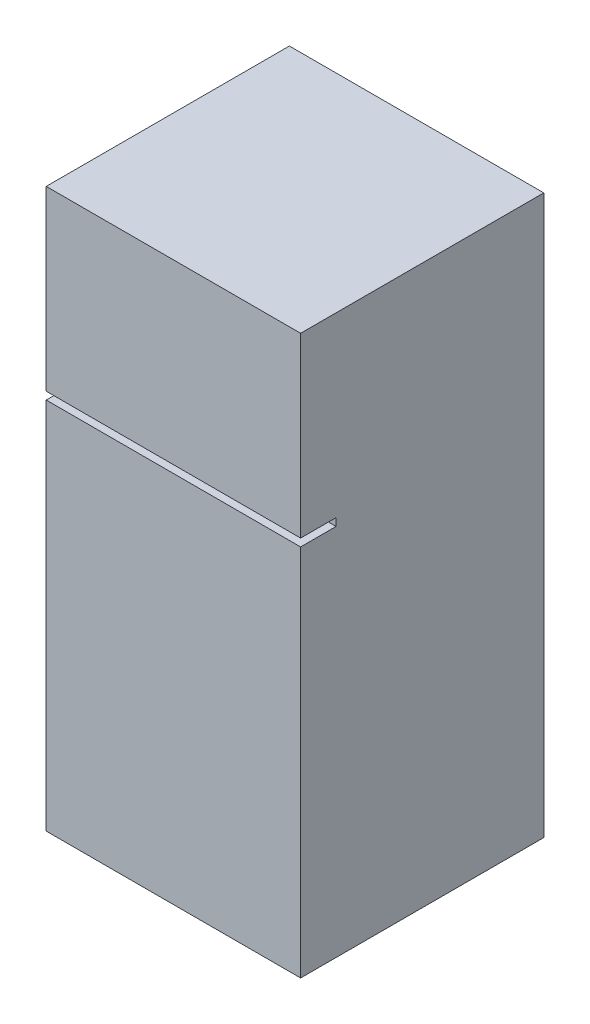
from build123d import *

# Parameters (mm, degrees)
SKETCH1_W           = 717.55
SKETCH1_H           = 685.8
BOSS_EXTRUDE1_DEPTH = 1574.8
SKETCH2_W           = 824.070977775
SKETCH2_H           = 21.531272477
CUT_EXTRUDE1_DEPTH  = 100


with BuildPart() as part:
    # Sketch1 → Boss-Extrude1 (new body)
    with BuildSketch(Plane(origin=(0, 0, 0), x_dir=(1, 0, 0), z_dir=(0, 1, 0))):
        with Locations((358.775, 342.9)):
            Rectangle(SKETCH1_W, SKETCH1_H)
    extrude(amount=BOSS_EXTRUDE1_DEPTH)

    # Sketch2 → Cut-Extrude1 (cut)
    with BuildSketch(Plane.XY):
        with Locations((372.05000982, 1063.703617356)):
            Rectangle(SKETCH2_W, SKETCH2_H)
    extrude(amount=-CUT_EXTRUDE1_DEPTH, mode=Mode.SUBTRACT)


solid = part.part
